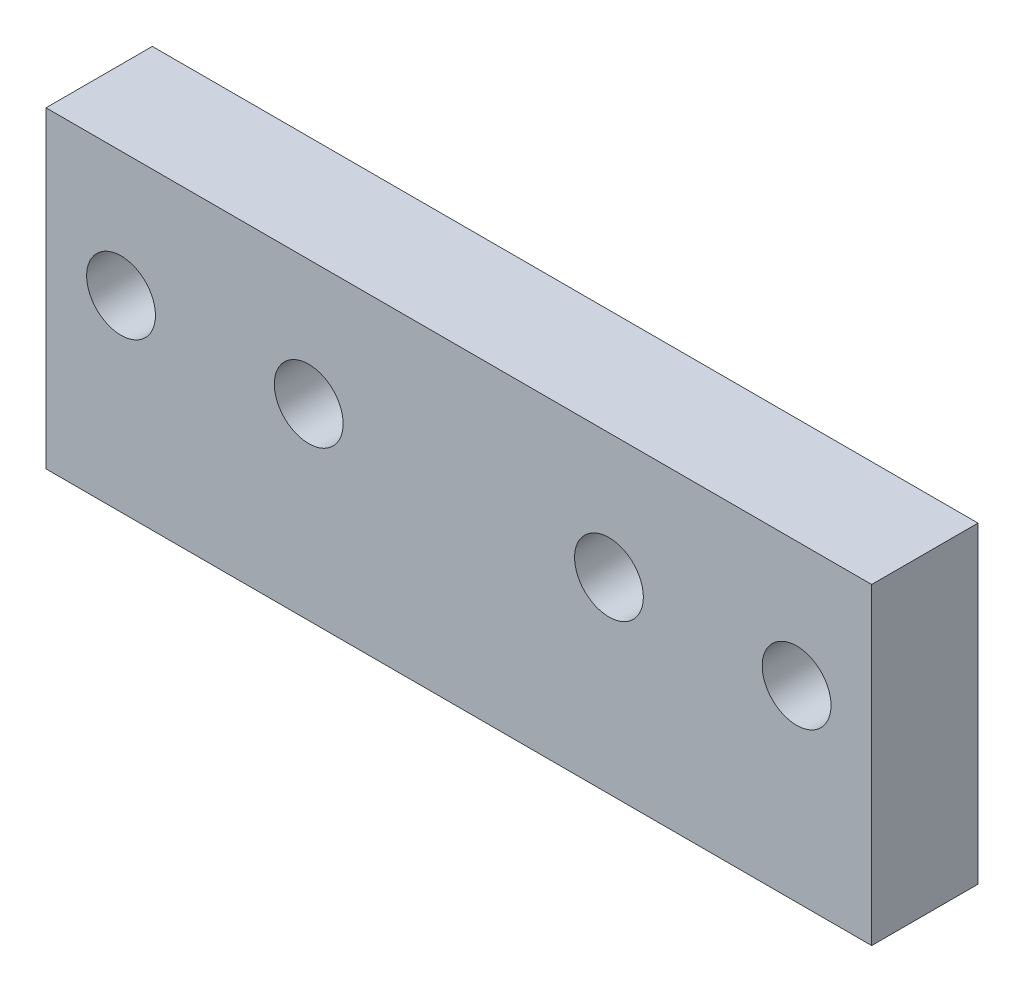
ISO-10303-21;
HEADER;
FILE_DESCRIPTION(('STEP AP214'),'2;1');
FILE_NAME('part.step','',(''),(''),'','','');
FILE_SCHEMA(('AUTOMOTIVE_DESIGN { 1 0 10303 214 1 1 1 1 }'));
ENDSEC;
DATA;
#1=APPLICATION_CONTEXT('core data for automotive mechanical design processes');
#2=APPLICATION_PROTOCOL_DEFINITION('international standard','automotive_design',2000,#1);
#3=PRODUCT_CONTEXT('',#1,'mechanical');
#4=PRODUCT('Part','Part','',(#3));
#5=PRODUCT_RELATED_PRODUCT_CATEGORY('part','',(#4));
#6=PRODUCT_DEFINITION_FORMATION('','',#4);
#7=PRODUCT_DEFINITION_CONTEXT('part definition',#1,'design');
#8=PRODUCT_DEFINITION('design','',#6,#7);
#9=PRODUCT_DEFINITION_SHAPE('','',#8);
#10=(LENGTH_UNIT() NAMED_UNIT(*) SI_UNIT(.MILLI.,.METRE.));
#11=(NAMED_UNIT(*) PLANE_ANGLE_UNIT() SI_UNIT($,.RADIAN.));
#12=(NAMED_UNIT(*) SI_UNIT($,.STERADIAN.) SOLID_ANGLE_UNIT());
#13=UNCERTAINTY_MEASURE_WITH_UNIT(LENGTH_MEASURE(1.E-05),#10,'distance_accuracy_value','');
#14=(GEOMETRIC_REPRESENTATION_CONTEXT(3) GLOBAL_UNCERTAINTY_ASSIGNED_CONTEXT((#13)) GLOBAL_UNIT_ASSIGNED_CONTEXT((#10,
#11,#12)) REPRESENTATION_CONTEXT('',''));
#15=CARTESIAN_POINT('',(0.,0.,0.));
#16=DIRECTION('',(0.,0.,1.));
#17=DIRECTION('',(1.,0.,0.));
#18=AXIS2_PLACEMENT_3D('',#15,#16,#17);
#19=CARTESIAN_POINT('',(0.,25.,8.5));
#20=DIRECTION('',(0.,-1.,0.));
#21=DIRECTION('',(0.,0.,-1.));
#22=AXIS2_PLACEMENT_3D('',#19,#20,#21);
#23=PLANE('',#22);
#24=DIRECTION('',(-1.,0.,0.));
#25=VECTOR('',#24,1.);
#26=CARTESIAN_POINT('',(0.,25.,0.));
#27=LINE('',#26,#25);
#28=CARTESIAN_POINT('',(66.,25.,0.));
#29=VERTEX_POINT('',#28);
#30=CARTESIAN_POINT('',(0.,25.,0.));
#31=VERTEX_POINT('',#30);
#32=EDGE_CURVE('E75',#29,#31,#27,.T.);
#33=ORIENTED_EDGE('',*,*,#32,.T.);
#34=DIRECTION('',(0.,0.,-1.));
#35=VECTOR('',#34,1.);
#36=CARTESIAN_POINT('',(0.,25.,8.5));
#37=LINE('',#36,#35);
#38=CARTESIAN_POINT('',(0.,25.,8.5));
#39=VERTEX_POINT('',#38);
#40=EDGE_CURVE('E70',#39,#31,#37,.T.);
#41=ORIENTED_EDGE('',*,*,#40,.F.);
#42=DIRECTION('',(-1.,0.,0.));
#43=VECTOR('',#42,1.);
#44=CARTESIAN_POINT('',(0.,25.,8.5));
#45=LINE('',#44,#43);
#46=CARTESIAN_POINT('',(66.,25.,8.5));
#47=VERTEX_POINT('',#46);
#48=EDGE_CURVE('E72',#47,#39,#45,.T.);
#49=ORIENTED_EDGE('',*,*,#48,.F.);
#50=DIRECTION('',(0.,0.,-1.));
#51=VECTOR('',#50,1.);
#52=CARTESIAN_POINT('',(66.,25.,8.5));
#53=LINE('',#52,#51);
#54=EDGE_CURVE('E11',#47,#29,#53,.T.);
#55=ORIENTED_EDGE('',*,*,#54,.T.);
#56=EDGE_LOOP('',(#33,#41,#49,#55));
#57=FACE_BOUND('',#56,.T.);
#58=ADVANCED_FACE('F17',(#57),#23,.F.);
#59=CARTESIAN_POINT('',(66.,0.,8.5));
#60=DIRECTION('',(-1.,0.,0.));
#61=DIRECTION('',(0.,0.,1.));
#62=AXIS2_PLACEMENT_3D('',#59,#60,#61);
#63=PLANE('',#62);
#64=DIRECTION('',(0.,1.,0.));
#65=VECTOR('',#64,1.);
#66=CARTESIAN_POINT('',(66.,0.,0.));
#67=LINE('',#66,#65);
#68=CARTESIAN_POINT('',(66.,0.,0.));
#69=VERTEX_POINT('',#68);
#70=EDGE_CURVE('E114',#69,#29,#67,.T.);
#71=ORIENTED_EDGE('',*,*,#70,.T.);
#72=ORIENTED_EDGE('',*,*,#54,.F.);
#73=DIRECTION('',(0.,1.,0.));
#74=VECTOR('',#73,1.);
#75=CARTESIAN_POINT('',(66.,0.,8.5));
#76=LINE('',#75,#74);
#77=CARTESIAN_POINT('',(66.,0.,8.5));
#78=VERTEX_POINT('',#77);
#79=EDGE_CURVE('E88',#78,#47,#76,.T.);
#80=ORIENTED_EDGE('',*,*,#79,.F.);
#81=DIRECTION('',(0.,0.,-1.));
#82=VECTOR('',#81,1.);
#83=CARTESIAN_POINT('',(66.,0.,8.5));
#84=LINE('',#83,#82);
#85=EDGE_CURVE('E25',#78,#69,#84,.T.);
#86=ORIENTED_EDGE('',*,*,#85,.T.);
#87=EDGE_LOOP('',(#71,#72,#80,#86));
#88=FACE_BOUND('',#87,.T.);
#89=ADVANCED_FACE('F389',(#88),#63,.F.);
#90=CARTESIAN_POINT('',(0.,0.,8.5));
#91=DIRECTION('',(0.,1.,0.));
#92=DIRECTION('',(1.,0.,0.));
#93=AXIS2_PLACEMENT_3D('',#90,#91,#92);
#94=PLANE('',#93);
#95=DIRECTION('',(1.,0.,0.));
#96=VECTOR('',#95,1.);
#97=CARTESIAN_POINT('',(0.,0.,0.));
#98=LINE('',#97,#96);
#99=CARTESIAN_POINT('',(0.,0.,0.));
#100=VERTEX_POINT('',#99);
#101=EDGE_CURVE('E119',#100,#69,#98,.T.);
#102=ORIENTED_EDGE('',*,*,#101,.T.);
#103=ORIENTED_EDGE('',*,*,#85,.F.);
#104=DIRECTION('',(1.,0.,0.));
#105=VECTOR('',#104,1.);
#106=CARTESIAN_POINT('',(0.,0.,8.5));
#107=LINE('',#106,#105);
#108=CARTESIAN_POINT('',(0.,0.,8.5));
#109=VERTEX_POINT('',#108);
#110=EDGE_CURVE('E95',#109,#78,#107,.T.);
#111=ORIENTED_EDGE('',*,*,#110,.F.);
#112=DIRECTION('',(0.,0.,-1.));
#113=VECTOR('',#112,1.);
#114=CARTESIAN_POINT('',(0.,0.,8.5));
#115=LINE('',#114,#113);
#116=EDGE_CURVE('E81',#109,#100,#115,.T.);
#117=ORIENTED_EDGE('',*,*,#116,.T.);
#118=EDGE_LOOP('',(#102,#103,#111,#117));
#119=FACE_BOUND('',#118,.T.);
#120=ADVANCED_FACE('F396',(#119),#94,.F.);
#121=CARTESIAN_POINT('',(0.,0.,8.5));
#122=DIRECTION('',(1.,0.,0.));
#123=DIRECTION('',(0.,1.,0.));
#124=AXIS2_PLACEMENT_3D('',#121,#122,#123);
#125=PLANE('',#124);
#126=DIRECTION('',(0.,-1.,0.));
#127=VECTOR('',#126,1.);
#128=CARTESIAN_POINT('',(0.,0.,0.));
#129=LINE('',#128,#127);
#130=EDGE_CURVE('E90',#31,#100,#129,.T.);
#131=ORIENTED_EDGE('',*,*,#130,.T.);
#132=ORIENTED_EDGE('',*,*,#116,.F.);
#133=DIRECTION('',(0.,-1.,0.));
#134=VECTOR('',#133,1.);
#135=CARTESIAN_POINT('',(0.,0.,8.5));
#136=LINE('',#135,#134);
#137=EDGE_CURVE('E87',#39,#109,#136,.T.);
#138=ORIENTED_EDGE('',*,*,#137,.F.);
#139=ORIENTED_EDGE('',*,*,#40,.T.);
#140=EDGE_LOOP('',(#131,#132,#138,#139));
#141=FACE_BOUND('',#140,.T.);
#142=ADVANCED_FACE('F92',(#141),#125,.F.);
#143=CARTESIAN_POINT('',(0.,0.,0.));
#144=DIRECTION('',(0.,0.,-1.));
#145=DIRECTION('',(0.,-1.,0.));
#146=AXIS2_PLACEMENT_3D('',#143,#144,#145);
#147=PLANE('',#146);
#148=CARTESIAN_POINT('',(60.,15.,0.));
#149=DIRECTION('',(0.,0.,1.));
#150=DIRECTION('',(1.,0.,0.));
#151=AXIS2_PLACEMENT_3D('',#148,#149,#150);
#152=CIRCLE('',#151,2.75);
#153=CARTESIAN_POINT('',(62.75,15.,0.));
#154=VERTEX_POINT('',#153);
#155=EDGE_CURVE('E219',#154,#154,#152,.T.);
#156=ORIENTED_EDGE('',*,*,#155,.T.);
#157=EDGE_LOOP('',(#156));
#158=FACE_BOUND('',#157,.T.);
#159=CARTESIAN_POINT('',(21.,15.,0.));
#160=DIRECTION('',(0.,0.,1.));
#161=DIRECTION('',(1.,0.,0.));
#162=AXIS2_PLACEMENT_3D('',#159,#160,#161);
#163=CIRCLE('',#162,2.75);
#164=CARTESIAN_POINT('',(23.75,15.,0.));
#165=VERTEX_POINT('',#164);
#166=EDGE_CURVE('E184',#165,#165,#163,.T.);
#167=ORIENTED_EDGE('',*,*,#166,.T.);
#168=EDGE_LOOP('',(#167));
#169=FACE_BOUND('',#168,.T.);
#170=CARTESIAN_POINT('',(6.,15.,0.));
#171=DIRECTION('',(0.,0.,1.));
#172=DIRECTION('',(1.,0.,0.));
#173=AXIS2_PLACEMENT_3D('',#170,#171,#172);
#174=CIRCLE('',#173,2.75);
#175=CARTESIAN_POINT('',(8.75,15.,0.));
#176=VERTEX_POINT('',#175);
#177=EDGE_CURVE('E96',#176,#176,#174,.T.);
#178=ORIENTED_EDGE('',*,*,#177,.T.);
#179=EDGE_LOOP('',(#178));
#180=FACE_BOUND('',#179,.T.);
#181=CARTESIAN_POINT('',(45.,15.,0.));
#182=DIRECTION('',(0.,0.,1.));
#183=DIRECTION('',(1.,0.,0.));
#184=AXIS2_PLACEMENT_3D('',#181,#182,#183);
#185=CIRCLE('',#184,2.75);
#186=CARTESIAN_POINT('',(47.75,15.,0.));
#187=VERTEX_POINT('',#186);
#188=EDGE_CURVE('E201',#187,#187,#185,.T.);
#189=ORIENTED_EDGE('',*,*,#188,.T.);
#190=EDGE_LOOP('',(#189));
#191=FACE_BOUND('',#190,.T.);
#192=ORIENTED_EDGE('',*,*,#130,.F.);
#193=ORIENTED_EDGE('',*,*,#32,.F.);
#194=ORIENTED_EDGE('',*,*,#70,.F.);
#195=ORIENTED_EDGE('',*,*,#101,.F.);
#196=EDGE_LOOP('',(#192,#193,#194,#195));
#197=FACE_BOUND('',#196,.T.);
#198=ADVANCED_FACE('F411',(#158,#169,#180,#191,#197),#147,.T.);
#199=CARTESIAN_POINT('',(0.,0.,8.5));
#200=DIRECTION('',(0.,0.,-1.));
#201=DIRECTION('',(0.,-1.,0.));
#202=AXIS2_PLACEMENT_3D('',#199,#200,#201);
#203=PLANE('',#202);
#204=CARTESIAN_POINT('',(60.,15.,8.5));
#205=DIRECTION('',(0.,0.,1.));
#206=DIRECTION('',(1.,0.,0.));
#207=AXIS2_PLACEMENT_3D('',#204,#205,#206);
#208=CIRCLE('',#207,2.75);
#209=CARTESIAN_POINT('',(62.75,15.,8.5));
#210=VERTEX_POINT('',#209);
#211=EDGE_CURVE('E232',#210,#210,#208,.T.);
#212=ORIENTED_EDGE('',*,*,#211,.F.);
#213=EDGE_LOOP('',(#212));
#214=FACE_BOUND('',#213,.T.);
#215=CARTESIAN_POINT('',(45.,15.,8.5));
#216=DIRECTION('',(0.,0.,1.));
#217=DIRECTION('',(1.,0.,0.));
#218=AXIS2_PLACEMENT_3D('',#215,#216,#217);
#219=CIRCLE('',#218,2.75);
#220=CARTESIAN_POINT('',(47.75,15.,8.5));
#221=VERTEX_POINT('',#220);
#222=EDGE_CURVE('E210',#221,#221,#219,.T.);
#223=ORIENTED_EDGE('',*,*,#222,.F.);
#224=EDGE_LOOP('',(#223));
#225=FACE_BOUND('',#224,.T.);
#226=CARTESIAN_POINT('',(21.,15.,8.5));
#227=DIRECTION('',(0.,0.,1.));
#228=DIRECTION('',(1.,0.,0.));
#229=AXIS2_PLACEMENT_3D('',#226,#227,#228);
#230=CIRCLE('',#229,2.75);
#231=CARTESIAN_POINT('',(23.75,15.,8.5));
#232=VERTEX_POINT('',#231);
#233=EDGE_CURVE('E192',#232,#232,#230,.T.);
#234=ORIENTED_EDGE('',*,*,#233,.F.);
#235=EDGE_LOOP('',(#234));
#236=FACE_BOUND('',#235,.T.);
#237=CARTESIAN_POINT('',(6.,15.,8.5));
#238=DIRECTION('',(0.,0.,1.));
#239=DIRECTION('',(1.,0.,0.));
#240=AXIS2_PLACEMENT_3D('',#237,#238,#239);
#241=CIRCLE('',#240,2.75);
#242=CARTESIAN_POINT('',(8.75,15.,8.5));
#243=VERTEX_POINT('',#242);
#244=EDGE_CURVE('E106',#243,#243,#241,.T.);
#245=ORIENTED_EDGE('',*,*,#244,.F.);
#246=EDGE_LOOP('',(#245));
#247=FACE_BOUND('',#246,.T.);
#248=ORIENTED_EDGE('',*,*,#137,.T.);
#249=ORIENTED_EDGE('',*,*,#110,.T.);
#250=ORIENTED_EDGE('',*,*,#79,.T.);
#251=ORIENTED_EDGE('',*,*,#48,.T.);
#252=EDGE_LOOP('',(#248,#249,#250,#251));
#253=FACE_BOUND('',#252,.T.);
#254=ADVANCED_FACE('F85',(#214,#225,#236,#247,#253),#203,.F.);
#255=CARTESIAN_POINT('',(6.,15.,8.5));
#256=DIRECTION('',(0.,0.,-1.));
#257=DIRECTION('',(-1.,0.,0.));
#258=AXIS2_PLACEMENT_3D('',#255,#256,#257);
#259=CYLINDRICAL_SURFACE('',#258,2.75);
#260=ORIENTED_EDGE('',*,*,#177,.F.);
#261=EDGE_LOOP('',(#260));
#262=FACE_BOUND('',#261,.T.);
#263=ORIENTED_EDGE('',*,*,#244,.T.);
#264=EDGE_LOOP('',(#263));
#265=FACE_BOUND('',#264,.T.);
#266=ADVANCED_FACE('F290',(#262,#265),#259,.F.);
#267=CARTESIAN_POINT('',(21.,15.,8.5));
#268=DIRECTION('',(0.,0.,-1.));
#269=DIRECTION('',(-1.,0.,0.));
#270=AXIS2_PLACEMENT_3D('',#267,#268,#269);
#271=CYLINDRICAL_SURFACE('',#270,2.75);
#272=ORIENTED_EDGE('',*,*,#166,.F.);
#273=EDGE_LOOP('',(#272));
#274=FACE_BOUND('',#273,.T.);
#275=ORIENTED_EDGE('',*,*,#233,.T.);
#276=EDGE_LOOP('',(#275));
#277=FACE_BOUND('',#276,.T.);
#278=ADVANCED_FACE('F278',(#274,#277),#271,.F.);
#279=CARTESIAN_POINT('',(45.,15.,8.5));
#280=DIRECTION('',(0.,0.,-1.));
#281=DIRECTION('',(-1.,0.,0.));
#282=AXIS2_PLACEMENT_3D('',#279,#280,#281);
#283=CYLINDRICAL_SURFACE('',#282,2.75);
#284=ORIENTED_EDGE('',*,*,#188,.F.);
#285=EDGE_LOOP('',(#284));
#286=FACE_BOUND('',#285,.T.);
#287=ORIENTED_EDGE('',*,*,#222,.T.);
#288=EDGE_LOOP('',(#287));
#289=FACE_BOUND('',#288,.T.);
#290=ADVANCED_FACE('F265',(#286,#289),#283,.F.);
#291=CARTESIAN_POINT('',(60.,15.,8.5));
#292=DIRECTION('',(0.,0.,-1.));
#293=DIRECTION('',(-1.,0.,0.));
#294=AXIS2_PLACEMENT_3D('',#291,#292,#293);
#295=CYLINDRICAL_SURFACE('',#294,2.75);
#296=ORIENTED_EDGE('',*,*,#155,.F.);
#297=EDGE_LOOP('',(#296));
#298=FACE_BOUND('',#297,.T.);
#299=ORIENTED_EDGE('',*,*,#211,.T.);
#300=EDGE_LOOP('',(#299));
#301=FACE_BOUND('',#300,.T.);
#302=ADVANCED_FACE('F260',(#298,#301),#295,.F.);
#303=CLOSED_SHELL('',(#58,#89,#120,#142,#198,#254,#266,#278,#290,#302));
#304=MANIFOLD_SOLID_BREP('B1',#303);
#305=ADVANCED_BREP_SHAPE_REPRESENTATION('',(#18,#304),#14);
#306=SHAPE_DEFINITION_REPRESENTATION(#9,#305);
ENDSEC;
END-ISO-10303-21;
